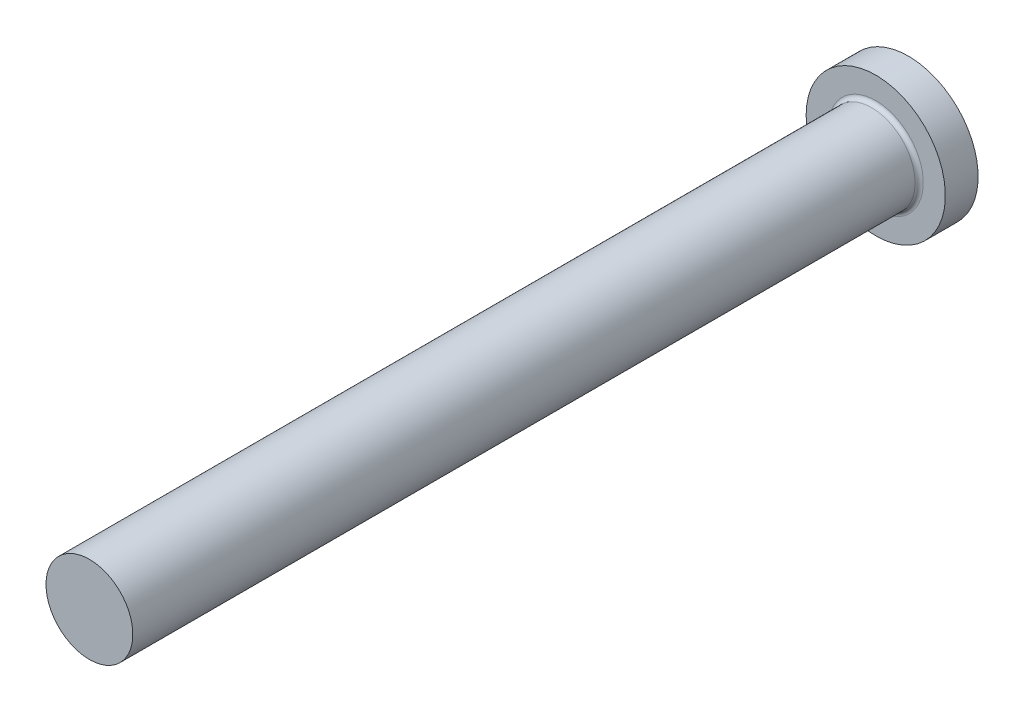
from build123d import *

# Parameters (mm, degrees)
FILLET1_R = 0.5


with BuildPart() as part:
    # FV → Revolve1 (revolve)
    with BuildSketch(Plane(origin=(0, 0, 0), x_dir=(1, 0, 0), z_dir=(0, 1, 0)), mode=Mode.PRIVATE) as revolve1_sk:
        Polygon((0, 0), (8.5, 0), (8.5, -4), (5.3, -4), (5.3, -100), (0, -100), align=None)
    revolve(revolve1_sk.sketch.rotate(Axis((0, 0, -9.033228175), (0, 0, 1)), 180), axis=Axis((0, 0, -9.033228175), (0, 0, 1)))

    # Fillet1
    fillet1_edges = [part.edges().sort_by_distance(p)[0] for p in [
        (5.3, 0, 4),
    ]]
    fillet(fillet1_edges, radius=FILLET1_R)


solid = part.part
